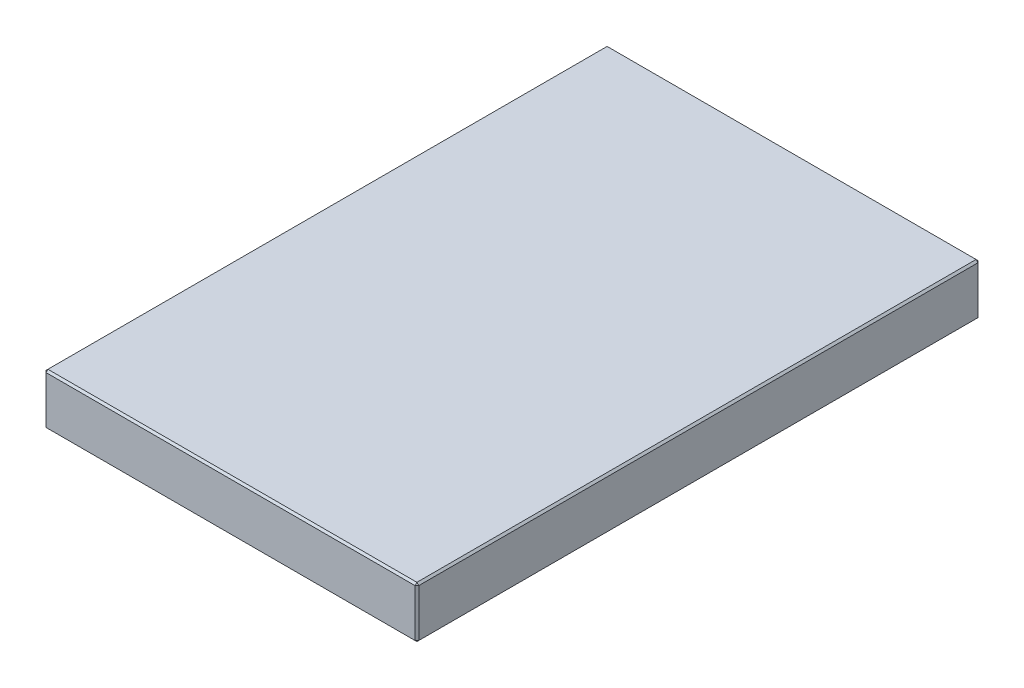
ISO-10303-21;
HEADER;
FILE_DESCRIPTION(('STEP AP214'),'2;1');
FILE_NAME('part.step','',(''),(''),'','','');
FILE_SCHEMA(('AUTOMOTIVE_DESIGN { 1 0 10303 214 1 1 1 1 }'));
ENDSEC;
DATA;
#1=APPLICATION_CONTEXT('core data for automotive mechanical design processes');
#2=APPLICATION_PROTOCOL_DEFINITION('international standard','automotive_design',2000,#1);
#3=PRODUCT_CONTEXT('',#1,'mechanical');
#4=PRODUCT('Part','Part','',(#3));
#5=PRODUCT_RELATED_PRODUCT_CATEGORY('part','',(#4));
#6=PRODUCT_DEFINITION_FORMATION('','',#4);
#7=PRODUCT_DEFINITION_CONTEXT('part definition',#1,'design');
#8=PRODUCT_DEFINITION('design','',#6,#7);
#9=PRODUCT_DEFINITION_SHAPE('','',#8);
#10=(LENGTH_UNIT() NAMED_UNIT(*) SI_UNIT(.MILLI.,.METRE.));
#11=(NAMED_UNIT(*) PLANE_ANGLE_UNIT() SI_UNIT($,.RADIAN.));
#12=(NAMED_UNIT(*) SI_UNIT($,.STERADIAN.) SOLID_ANGLE_UNIT());
#13=UNCERTAINTY_MEASURE_WITH_UNIT(LENGTH_MEASURE(1.E-05),#10,'distance_accuracy_value','');
#14=(GEOMETRIC_REPRESENTATION_CONTEXT(3) GLOBAL_UNCERTAINTY_ASSIGNED_CONTEXT((#13)) GLOBAL_UNIT_ASSIGNED_CONTEXT((#10,
#11,#12)) REPRESENTATION_CONTEXT('',''));
#15=CARTESIAN_POINT('',(0.,0.,0.));
#16=DIRECTION('',(0.,0.,1.));
#17=DIRECTION('',(1.,0.,0.));
#18=AXIS2_PLACEMENT_3D('',#15,#16,#17);
#19=CARTESIAN_POINT('',(-98.,27.,148.));
#20=DIRECTION('',(1.,0.,0.));
#21=DIRECTION('',(0.,0.,-1.));
#22=AXIS2_PLACEMENT_3D('',#19,#20,#21);
#23=PLANE('',#22);
#24=DIRECTION('',(0.,-1.,0.));
#25=VECTOR('',#24,1.);
#26=CARTESIAN_POINT('',(-98.,27.,-147.));
#27=LINE('',#26,#25);
#28=CARTESIAN_POINT('',(-98.,26.,-147.));
#29=VERTEX_POINT('',#28);
#30=CARTESIAN_POINT('',(-98.,1.,-147.));
#31=VERTEX_POINT('',#30);
#32=EDGE_CURVE('E115',#29,#31,#27,.T.);
#33=ORIENTED_EDGE('',*,*,#32,.T.);
#34=DIRECTION('',(0.,0.,1.));
#35=VECTOR('',#34,1.);
#36=CARTESIAN_POINT('',(-98.,1.,148.));
#37=LINE('',#36,#35);
#38=CARTESIAN_POINT('',(-98.,1.,147.));
#39=VERTEX_POINT('',#38);
#40=EDGE_CURVE('E111',#31,#39,#37,.T.);
#41=ORIENTED_EDGE('',*,*,#40,.T.);
#42=DIRECTION('',(0.,1.,0.));
#43=VECTOR('',#42,1.);
#44=CARTESIAN_POINT('',(-98.,27.,147.));
#45=LINE('',#44,#43);
#46=CARTESIAN_POINT('',(-98.,26.,147.));
#47=VERTEX_POINT('',#46);
#48=EDGE_CURVE('E104',#39,#47,#45,.T.);
#49=ORIENTED_EDGE('',*,*,#48,.T.);
#50=DIRECTION('',(0.,0.,-1.));
#51=VECTOR('',#50,1.);
#52=CARTESIAN_POINT('',(-98.,26.,-148.));
#53=LINE('',#52,#51);
#54=EDGE_CURVE('E108',#47,#29,#53,.T.);
#55=ORIENTED_EDGE('',*,*,#54,.T.);
#56=EDGE_LOOP('',(#33,#41,#49,#55));
#57=FACE_BOUND('',#56,.T.);
#58=ADVANCED_FACE('F16',(#57),#23,.F.);
#59=CARTESIAN_POINT('',(98.,27.,148.));
#60=DIRECTION('',(0.,0.,-1.));
#61=DIRECTION('',(-1.,0.,0.));
#62=AXIS2_PLACEMENT_3D('',#59,#60,#61);
#63=PLANE('',#62);
#64=DIRECTION('',(-1.,0.,0.));
#65=VECTOR('',#64,1.);
#66=CARTESIAN_POINT('',(-98.,26.,148.));
#67=LINE('',#66,#65);
#68=CARTESIAN_POINT('',(97.,26.,148.));
#69=VERTEX_POINT('',#68);
#70=CARTESIAN_POINT('',(-97.,26.,148.));
#71=VERTEX_POINT('',#70);
#72=EDGE_CURVE('E165',#69,#71,#67,.T.);
#73=ORIENTED_EDGE('',*,*,#72,.T.);
#74=DIRECTION('',(0.,-1.,0.));
#75=VECTOR('',#74,1.);
#76=CARTESIAN_POINT('',(-97.,27.,148.));
#77=LINE('',#76,#75);
#78=CARTESIAN_POINT('',(-97.,1.,148.));
#79=VERTEX_POINT('',#78);
#80=EDGE_CURVE('E123',#71,#79,#77,.T.);
#81=ORIENTED_EDGE('',*,*,#80,.T.);
#82=DIRECTION('',(1.,0.,0.));
#83=VECTOR('',#82,1.);
#84=CARTESIAN_POINT('',(98.,1.,148.));
#85=LINE('',#84,#83);
#86=CARTESIAN_POINT('',(97.,1.,148.));
#87=VERTEX_POINT('',#86);
#88=EDGE_CURVE('E169',#79,#87,#85,.T.);
#89=ORIENTED_EDGE('',*,*,#88,.T.);
#90=DIRECTION('',(0.,1.,0.));
#91=VECTOR('',#90,1.);
#92=CARTESIAN_POINT('',(97.,27.,148.));
#93=LINE('',#92,#91);
#94=EDGE_CURVE('E167',#87,#69,#93,.T.);
#95=ORIENTED_EDGE('',*,*,#94,.T.);
#96=EDGE_LOOP('',(#73,#81,#89,#95));
#97=FACE_BOUND('',#96,.T.);
#98=ADVANCED_FACE('F276',(#97),#63,.F.);
#99=CARTESIAN_POINT('',(98.,27.,148.));
#100=DIRECTION('',(-1.,0.,0.));
#101=DIRECTION('',(0.,0.,1.));
#102=AXIS2_PLACEMENT_3D('',#99,#100,#101);
#103=PLANE('',#102);
#104=DIRECTION('',(0.,0.,-1.));
#105=VECTOR('',#104,1.);
#106=CARTESIAN_POINT('',(98.,1.,148.));
#107=LINE('',#106,#105);
#108=CARTESIAN_POINT('',(98.,1.,147.));
#109=VERTEX_POINT('',#108);
#110=CARTESIAN_POINT('',(98.,1.,-147.));
#111=VERTEX_POINT('',#110);
#112=EDGE_CURVE('E160',#109,#111,#107,.T.);
#113=ORIENTED_EDGE('',*,*,#112,.T.);
#114=DIRECTION('',(0.,1.,0.));
#115=VECTOR('',#114,1.);
#116=CARTESIAN_POINT('',(98.,27.,-147.));
#117=LINE('',#116,#115);
#118=CARTESIAN_POINT('',(98.,26.,-147.));
#119=VERTEX_POINT('',#118);
#120=EDGE_CURVE('E162',#111,#119,#117,.T.);
#121=ORIENTED_EDGE('',*,*,#120,.T.);
#122=DIRECTION('',(0.,0.,1.));
#123=VECTOR('',#122,1.);
#124=CARTESIAN_POINT('',(98.,26.,148.));
#125=LINE('',#124,#123);
#126=CARTESIAN_POINT('',(98.,26.,147.));
#127=VERTEX_POINT('',#126);
#128=EDGE_CURVE('E156',#119,#127,#125,.T.);
#129=ORIENTED_EDGE('',*,*,#128,.T.);
#130=DIRECTION('',(0.,-1.,0.));
#131=VECTOR('',#130,1.);
#132=CARTESIAN_POINT('',(98.,27.,147.));
#133=LINE('',#132,#131);
#134=EDGE_CURVE('E158',#127,#109,#133,.T.);
#135=ORIENTED_EDGE('',*,*,#134,.T.);
#136=EDGE_LOOP('',(#113,#121,#129,#135));
#137=FACE_BOUND('',#136,.T.);
#138=ADVANCED_FACE('F255',(#137),#103,.F.);
#139=CARTESIAN_POINT('',(98.,27.,-148.));
#140=DIRECTION('',(0.,0.,1.));
#141=DIRECTION('',(1.,0.,0.));
#142=AXIS2_PLACEMENT_3D('',#139,#140,#141);
#143=PLANE('',#142);
#144=DIRECTION('',(0.,-1.,0.));
#145=VECTOR('',#144,1.);
#146=CARTESIAN_POINT('',(97.,27.,-148.));
#147=LINE('',#146,#145);
#148=CARTESIAN_POINT('',(97.,26.,-148.));
#149=VERTEX_POINT('',#148);
#150=CARTESIAN_POINT('',(97.,1.,-148.));
#151=VERTEX_POINT('',#150);
#152=EDGE_CURVE('E149',#149,#151,#147,.T.);
#153=ORIENTED_EDGE('',*,*,#152,.T.);
#154=DIRECTION('',(-1.,0.,0.));
#155=VECTOR('',#154,1.);
#156=CARTESIAN_POINT('',(98.,1.,-148.));
#157=LINE('',#156,#155);
#158=CARTESIAN_POINT('',(-97.,1.,-148.));
#159=VERTEX_POINT('',#158);
#160=EDGE_CURVE('E154',#151,#159,#157,.T.);
#161=ORIENTED_EDGE('',*,*,#160,.T.);
#162=DIRECTION('',(0.,1.,0.));
#163=VECTOR('',#162,1.);
#164=CARTESIAN_POINT('',(-97.,27.,-148.));
#165=LINE('',#164,#163);
#166=CARTESIAN_POINT('',(-97.,26.,-148.));
#167=VERTEX_POINT('',#166);
#168=EDGE_CURVE('E151',#159,#167,#165,.T.);
#169=ORIENTED_EDGE('',*,*,#168,.T.);
#170=DIRECTION('',(1.,0.,0.));
#171=VECTOR('',#170,1.);
#172=CARTESIAN_POINT('',(98.,26.,-148.));
#173=LINE('',#172,#171);
#174=EDGE_CURVE('E147',#167,#149,#173,.T.);
#175=ORIENTED_EDGE('',*,*,#174,.T.);
#176=EDGE_LOOP('',(#153,#161,#169,#175));
#177=FACE_BOUND('',#176,.T.);
#178=ADVANCED_FACE('F285',(#177),#143,.F.);
#179=CARTESIAN_POINT('',(0.,27.,0.));
#180=DIRECTION('',(0.,1.,0.));
#181=DIRECTION('',(0.,0.,1.));
#182=AXIS2_PLACEMENT_3D('',#179,#180,#181);
#183=PLANE('',#182);
#184=DIRECTION('',(0.,0.,-1.));
#185=VECTOR('',#184,1.);
#186=CARTESIAN_POINT('',(97.,27.,-148.));
#187=LINE('',#186,#185);
#188=CARTESIAN_POINT('',(97.,27.,147.));
#189=VERTEX_POINT('',#188);
#190=CARTESIAN_POINT('',(97.,27.,-147.));
#191=VERTEX_POINT('',#190);
#192=EDGE_CURVE('E25',#189,#191,#187,.T.);
#193=ORIENTED_EDGE('',*,*,#192,.T.);
#194=DIRECTION('',(-1.,0.,0.));
#195=VECTOR('',#194,1.);
#196=CARTESIAN_POINT('',(-98.,27.,-147.));
#197=LINE('',#196,#195);
#198=CARTESIAN_POINT('',(-97.,27.,-147.));
#199=VERTEX_POINT('',#198);
#200=EDGE_CURVE('E10',#191,#199,#197,.T.);
#201=ORIENTED_EDGE('',*,*,#200,.T.);
#202=DIRECTION('',(0.,0.,1.));
#203=VECTOR('',#202,1.);
#204=CARTESIAN_POINT('',(-97.,27.,148.));
#205=LINE('',#204,#203);
#206=CARTESIAN_POINT('',(-97.,27.,147.));
#207=VERTEX_POINT('',#206);
#208=EDGE_CURVE('E181',#199,#207,#205,.T.);
#209=ORIENTED_EDGE('',*,*,#208,.T.);
#210=DIRECTION('',(1.,0.,0.));
#211=VECTOR('',#210,1.);
#212=CARTESIAN_POINT('',(98.,27.,147.));
#213=LINE('',#212,#211);
#214=EDGE_CURVE('E36',#207,#189,#213,.T.);
#215=ORIENTED_EDGE('',*,*,#214,.T.);
#216=EDGE_LOOP('',(#193,#201,#209,#215));
#217=FACE_BOUND('',#216,.T.);
#218=ADVANCED_FACE('F351',(#217),#183,.T.);
#219=CARTESIAN_POINT('',(0.,0.,0.));
#220=DIRECTION('',(0.,1.,0.));
#221=DIRECTION('',(0.,0.,1.));
#222=AXIS2_PLACEMENT_3D('',#219,#220,#221);
#223=PLANE('',#222);
#224=DIRECTION('',(0.,0.,1.));
#225=VECTOR('',#224,1.);
#226=CARTESIAN_POINT('',(97.,0.,0.));
#227=LINE('',#226,#225);
#228=CARTESIAN_POINT('',(97.,0.,-147.));
#229=VERTEX_POINT('',#228);
#230=CARTESIAN_POINT('',(97.,0.,147.));
#231=VERTEX_POINT('',#230);
#232=EDGE_CURVE('E172',#229,#231,#227,.T.);
#233=ORIENTED_EDGE('',*,*,#232,.T.);
#234=DIRECTION('',(-1.,0.,0.));
#235=VECTOR('',#234,1.);
#236=CARTESIAN_POINT('',(0.,0.,147.));
#237=LINE('',#236,#235);
#238=CARTESIAN_POINT('',(-97.,0.,147.));
#239=VERTEX_POINT('',#238);
#240=EDGE_CURVE('E178',#231,#239,#237,.T.);
#241=ORIENTED_EDGE('',*,*,#240,.T.);
#242=DIRECTION('',(0.,0.,-1.));
#243=VECTOR('',#242,1.);
#244=CARTESIAN_POINT('',(-97.,0.,0.));
#245=LINE('',#244,#243);
#246=CARTESIAN_POINT('',(-97.,0.,-147.));
#247=VERTEX_POINT('',#246);
#248=EDGE_CURVE('E176',#239,#247,#245,.T.);
#249=ORIENTED_EDGE('',*,*,#248,.T.);
#250=DIRECTION('',(1.,0.,0.));
#251=VECTOR('',#250,1.);
#252=CARTESIAN_POINT('',(0.,0.,-147.));
#253=LINE('',#252,#251);
#254=EDGE_CURVE('E174',#247,#229,#253,.T.);
#255=ORIENTED_EDGE('',*,*,#254,.T.);
#256=EDGE_LOOP('',(#233,#241,#249,#255));
#257=FACE_BOUND('',#256,.T.);
#258=ADVANCED_FACE('F247',(#257),#223,.F.);
#259=CARTESIAN_POINT('',(98.,27.,147.));
#260=DIRECTION('',(-0.707106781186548,0.,-0.707106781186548));
#261=DIRECTION('',(0.,-1.,0.));
#262=AXIS2_PLACEMENT_3D('',#259,#260,#261);
#263=PLANE('',#262);
#264=DIRECTION('',(-0.707106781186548,0.,0.707106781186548));
#265=VECTOR('',#264,1.);
#266=CARTESIAN_POINT('',(97.,26.,148.));
#267=LINE('',#266,#265);
#268=EDGE_CURVE('E20',#69,#127,#267,.F.);
#269=ORIENTED_EDGE('',*,*,#268,.F.);
#270=ORIENTED_EDGE('',*,*,#94,.F.);
#271=DIRECTION('',(0.707106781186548,0.,-0.707106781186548));
#272=VECTOR('',#271,1.);
#273=CARTESIAN_POINT('',(97.,1.,148.));
#274=LINE('',#273,#272);
#275=EDGE_CURVE('E143',#109,#87,#274,.F.);
#276=ORIENTED_EDGE('',*,*,#275,.F.);
#277=ORIENTED_EDGE('',*,*,#134,.F.);
#278=EDGE_LOOP('',(#269,#270,#276,#277));
#279=FACE_BOUND('',#278,.T.);
#280=ADVANCED_FACE('F18',(#279),#263,.F.);
#281=CARTESIAN_POINT('',(97.,26.,148.));
#282=DIRECTION('',(0.577350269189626,0.577350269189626,0.577350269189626));
#283=DIRECTION('',(0.707106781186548,0.,-0.707106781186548));
#284=AXIS2_PLACEMENT_3D('',#281,#282,#283);
#285=PLANE('',#284);
#286=DIRECTION('',(0.,-0.707106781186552,0.707106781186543));
#287=VECTOR('',#286,1.);
#288=CARTESIAN_POINT('',(97.,26.,148.));
#289=LINE('',#288,#287);
#290=EDGE_CURVE('E227',#69,#189,#289,.F.);
#291=ORIENTED_EDGE('',*,*,#290,.F.);
#292=ORIENTED_EDGE('',*,*,#268,.T.);
#293=DIRECTION('',(-0.707106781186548,0.707106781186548,0.));
#294=VECTOR('',#293,1.);
#295=CARTESIAN_POINT('',(97.5,26.5,147.));
#296=LINE('',#295,#294);
#297=EDGE_CURVE('E229',#189,#127,#296,.F.);
#298=ORIENTED_EDGE('',*,*,#297,.F.);
#299=EDGE_LOOP('',(#291,#292,#298));
#300=FACE_BOUND('',#299,.T.);
#301=ADVANCED_FACE('F271',(#300),#285,.T.);
#302=CARTESIAN_POINT('',(97.,1.,148.));
#303=DIRECTION('',(0.577350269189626,-0.577350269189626,0.577350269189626));
#304=DIRECTION('',(0.707106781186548,0.,-0.707106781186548));
#305=AXIS2_PLACEMENT_3D('',#302,#303,#304);
#306=PLANE('',#305);
#307=DIRECTION('',(-0.707106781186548,-0.707106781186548,0.));
#308=VECTOR('',#307,1.);
#309=CARTESIAN_POINT('',(97.5,0.5,147.));
#310=LINE('',#309,#308);
#311=EDGE_CURVE('E221',#109,#231,#310,.T.);
#312=ORIENTED_EDGE('',*,*,#311,.F.);
#313=ORIENTED_EDGE('',*,*,#275,.T.);
#314=DIRECTION('',(0.,0.707106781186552,0.707106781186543));
#315=VECTOR('',#314,1.);
#316=CARTESIAN_POINT('',(97.,1.,148.));
#317=LINE('',#316,#315);
#318=EDGE_CURVE('E224',#231,#87,#317,.T.);
#319=ORIENTED_EDGE('',*,*,#318,.F.);
#320=EDGE_LOOP('',(#312,#313,#319));
#321=FACE_BOUND('',#320,.T.);
#322=ADVANCED_FACE('F236',(#321),#306,.T.);
#323=CARTESIAN_POINT('',(97.,27.,0.));
#324=DIRECTION('',(0.707106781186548,0.707106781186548,0.));
#325=DIRECTION('',(0.,0.,1.));
#326=AXIS2_PLACEMENT_3D('',#323,#324,#325);
#327=PLANE('',#326);
#328=ORIENTED_EDGE('',*,*,#297,.T.);
#329=ORIENTED_EDGE('',*,*,#128,.F.);
#330=DIRECTION('',(0.707106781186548,-0.707106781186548,0.));
#331=VECTOR('',#330,1.);
#332=CARTESIAN_POINT('',(98.,26.,-147.));
#333=LINE('',#332,#331);
#334=EDGE_CURVE('E216',#191,#119,#333,.T.);
#335=ORIENTED_EDGE('',*,*,#334,.F.);
#336=ORIENTED_EDGE('',*,*,#192,.F.);
#337=EDGE_LOOP('',(#328,#329,#335,#336));
#338=FACE_BOUND('',#337,.T.);
#339=ADVANCED_FACE('F266',(#338),#327,.T.);
#340=CARTESIAN_POINT('',(0.,27.,147.));
#341=DIRECTION('',(0.,0.707106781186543,0.707106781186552));
#342=DIRECTION('',(-1.,0.,0.));
#343=AXIS2_PLACEMENT_3D('',#340,#341,#342);
#344=PLANE('',#343);
#345=ORIENTED_EDGE('',*,*,#290,.T.);
#346=ORIENTED_EDGE('',*,*,#214,.F.);
#347=DIRECTION('',(0.,0.707106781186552,-0.707106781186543));
#348=VECTOR('',#347,1.);
#349=CARTESIAN_POINT('',(-97.,26.5,147.5));
#350=LINE('',#349,#348);
#351=EDGE_CURVE('E127',#71,#207,#350,.T.);
#352=ORIENTED_EDGE('',*,*,#351,.F.);
#353=ORIENTED_EDGE('',*,*,#72,.F.);
#354=EDGE_LOOP('',(#345,#346,#352,#353));
#355=FACE_BOUND('',#354,.T.);
#356=ADVANCED_FACE('F274',(#355),#344,.T.);
#357=CARTESIAN_POINT('',(-97.,27.,148.));
#358=DIRECTION('',(0.707106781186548,0.,-0.707106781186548));
#359=DIRECTION('',(0.,-1.,0.));
#360=AXIS2_PLACEMENT_3D('',#357,#358,#359);
#361=PLANE('',#360);
#362=DIRECTION('',(0.707106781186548,0.,0.707106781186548));
#363=VECTOR('',#362,1.);
#364=CARTESIAN_POINT('',(-97.,1.,148.));
#365=LINE('',#364,#363);
#366=EDGE_CURVE('E128',#79,#39,#365,.F.);
#367=ORIENTED_EDGE('',*,*,#366,.F.);
#368=ORIENTED_EDGE('',*,*,#80,.F.);
#369=DIRECTION('',(-0.707106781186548,0.,-0.707106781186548));
#370=VECTOR('',#369,1.);
#371=CARTESIAN_POINT('',(-98.,26.,147.));
#372=LINE('',#371,#370);
#373=EDGE_CURVE('E119',#47,#71,#372,.F.);
#374=ORIENTED_EDGE('',*,*,#373,.F.);
#375=ORIENTED_EDGE('',*,*,#48,.F.);
#376=EDGE_LOOP('',(#367,#368,#374,#375));
#377=FACE_BOUND('',#376,.T.);
#378=ADVANCED_FACE('F121',(#377),#361,.F.);
#379=CARTESIAN_POINT('',(98.,1.,148.));
#380=DIRECTION('',(0.,0.707106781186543,-0.707106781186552));
#381=DIRECTION('',(1.,0.,0.));
#382=AXIS2_PLACEMENT_3D('',#379,#380,#381);
#383=PLANE('',#382);
#384=ORIENTED_EDGE('',*,*,#318,.T.);
#385=ORIENTED_EDGE('',*,*,#88,.F.);
#386=DIRECTION('',(0.,-0.707106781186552,-0.707106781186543));
#387=VECTOR('',#386,1.);
#388=CARTESIAN_POINT('',(-97.,1.,148.));
#389=LINE('',#388,#387);
#390=EDGE_CURVE('E212',#239,#79,#389,.F.);
#391=ORIENTED_EDGE('',*,*,#390,.F.);
#392=ORIENTED_EDGE('',*,*,#240,.F.);
#393=EDGE_LOOP('',(#384,#385,#391,#392));
#394=FACE_BOUND('',#393,.T.);
#395=ADVANCED_FACE('F244',(#394),#383,.F.);
#396=CARTESIAN_POINT('',(98.,1.,148.));
#397=DIRECTION('',(-0.707106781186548,0.707106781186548,0.));
#398=DIRECTION('',(0.,0.,-1.));
#399=AXIS2_PLACEMENT_3D('',#396,#397,#398);
#400=PLANE('',#399);
#401=ORIENTED_EDGE('',*,*,#311,.T.);
#402=ORIENTED_EDGE('',*,*,#232,.F.);
#403=DIRECTION('',(0.707106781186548,0.707106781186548,0.));
#404=VECTOR('',#403,1.);
#405=CARTESIAN_POINT('',(97.5,0.5,-147.));
#406=LINE('',#405,#404);
#407=EDGE_CURVE('E209',#111,#229,#406,.F.);
#408=ORIENTED_EDGE('',*,*,#407,.F.);
#409=ORIENTED_EDGE('',*,*,#112,.F.);
#410=EDGE_LOOP('',(#401,#402,#408,#409));
#411=FACE_BOUND('',#410,.T.);
#412=ADVANCED_FACE('F252',(#411),#400,.F.);
#413=CARTESIAN_POINT('',(97.,27.,-148.));
#414=DIRECTION('',(-0.707106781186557,0.,0.707106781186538));
#415=DIRECTION('',(0.,-1.,0.));
#416=AXIS2_PLACEMENT_3D('',#413,#414,#415);
#417=PLANE('',#416);
#418=DIRECTION('',(0.707106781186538,0.,0.707106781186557));
#419=VECTOR('',#418,1.);
#420=CARTESIAN_POINT('',(98.,26.,-147.));
#421=LINE('',#420,#419);
#422=EDGE_CURVE('E218',#119,#149,#421,.F.);
#423=ORIENTED_EDGE('',*,*,#422,.F.);
#424=ORIENTED_EDGE('',*,*,#120,.F.);
#425=DIRECTION('',(-0.707106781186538,0.,-0.707106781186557));
#426=VECTOR('',#425,1.);
#427=CARTESIAN_POINT('',(97.,1.,-148.));
#428=LINE('',#427,#426);
#429=EDGE_CURVE('E206',#151,#111,#428,.F.);
#430=ORIENTED_EDGE('',*,*,#429,.F.);
#431=ORIENTED_EDGE('',*,*,#152,.F.);
#432=EDGE_LOOP('',(#423,#424,#430,#431));
#433=FACE_BOUND('',#432,.T.);
#434=ADVANCED_FACE('F259',(#433),#417,.F.);
#435=CARTESIAN_POINT('',(98.,26.,-147.));
#436=DIRECTION('',(0.577350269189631,0.577350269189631,-0.577350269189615));
#437=DIRECTION('',(-0.707106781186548,0.707106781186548,0.));
#438=AXIS2_PLACEMENT_3D('',#435,#436,#437);
#439=PLANE('',#438);
#440=ORIENTED_EDGE('',*,*,#334,.T.);
#441=ORIENTED_EDGE('',*,*,#422,.T.);
#442=DIRECTION('',(0.,0.707106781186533,0.707106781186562));
#443=VECTOR('',#442,1.);
#444=CARTESIAN_POINT('',(97.,26.5,-147.5));
#445=LINE('',#444,#443);
#446=EDGE_CURVE('E135',#191,#149,#445,.F.);
#447=ORIENTED_EDGE('',*,*,#446,.F.);
#448=EDGE_LOOP('',(#440,#441,#447));
#449=FACE_BOUND('',#448,.T.);
#450=ADVANCED_FACE('F326',(#449),#439,.T.);
#451=CARTESIAN_POINT('',(-98.,26.,147.));
#452=DIRECTION('',(-0.577350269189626,0.577350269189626,0.577350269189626));
#453=DIRECTION('',(0.707106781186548,0.,0.707106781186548));
#454=AXIS2_PLACEMENT_3D('',#451,#452,#453);
#455=PLANE('',#454);
#456=ORIENTED_EDGE('',*,*,#373,.T.);
#457=ORIENTED_EDGE('',*,*,#351,.T.);
#458=DIRECTION('',(-0.707106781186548,-0.707106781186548,0.));
#459=VECTOR('',#458,1.);
#460=CARTESIAN_POINT('',(-98.,26.,147.));
#461=LINE('',#460,#459);
#462=EDGE_CURVE('E131',#47,#207,#461,.F.);
#463=ORIENTED_EDGE('',*,*,#462,.F.);
#464=EDGE_LOOP('',(#456,#457,#463));
#465=FACE_BOUND('',#464,.T.);
#466=ADVANCED_FACE('F132',(#465),#455,.T.);
#467=CARTESIAN_POINT('',(-97.,1.,148.));
#468=DIRECTION('',(-0.577350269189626,-0.577350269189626,0.577350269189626));
#469=DIRECTION('',(0.707106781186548,0.,0.707106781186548));
#470=AXIS2_PLACEMENT_3D('',#467,#468,#469);
#471=PLANE('',#470);
#472=ORIENTED_EDGE('',*,*,#390,.T.);
#473=ORIENTED_EDGE('',*,*,#366,.T.);
#474=DIRECTION('',(-0.707106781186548,0.707106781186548,0.));
#475=VECTOR('',#474,1.);
#476=CARTESIAN_POINT('',(-97.5,0.5,147.));
#477=LINE('',#476,#475);
#478=EDGE_CURVE('E136',#239,#39,#477,.T.);
#479=ORIENTED_EDGE('',*,*,#478,.F.);
#480=EDGE_LOOP('',(#472,#473,#479));
#481=FACE_BOUND('',#480,.T.);
#482=ADVANCED_FACE('F319',(#481),#471,.T.);
#483=CARTESIAN_POINT('',(97.,1.,-148.));
#484=DIRECTION('',(0.577350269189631,-0.577350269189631,-0.577350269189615));
#485=DIRECTION('',(0.707106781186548,0.707106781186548,0.));
#486=AXIS2_PLACEMENT_3D('',#483,#484,#485);
#487=PLANE('',#486);
#488=ORIENTED_EDGE('',*,*,#429,.T.);
#489=ORIENTED_EDGE('',*,*,#407,.T.);
#490=DIRECTION('',(0.,-0.707106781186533,0.707106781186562));
#491=VECTOR('',#490,1.);
#492=CARTESIAN_POINT('',(97.,1.,-148.));
#493=LINE('',#492,#491);
#494=EDGE_CURVE('E199',#151,#229,#493,.T.);
#495=ORIENTED_EDGE('',*,*,#494,.F.);
#496=EDGE_LOOP('',(#488,#489,#495));
#497=FACE_BOUND('',#496,.T.);
#498=ADVANCED_FACE('F315',(#497),#487,.T.);
#499=CARTESIAN_POINT('',(0.,27.,-147.));
#500=DIRECTION('',(0.,0.707106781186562,-0.707106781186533));
#501=DIRECTION('',(1.,0.,0.));
#502=AXIS2_PLACEMENT_3D('',#499,#500,#501);
#503=PLANE('',#502);
#504=ORIENTED_EDGE('',*,*,#446,.T.);
#505=ORIENTED_EDGE('',*,*,#174,.F.);
#506=DIRECTION('',(0.,-0.707106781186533,-0.707106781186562));
#507=VECTOR('',#506,1.);
#508=CARTESIAN_POINT('',(-97.,26.,-148.));
#509=LINE('',#508,#507);
#510=EDGE_CURVE('E196',#199,#167,#509,.T.);
#511=ORIENTED_EDGE('',*,*,#510,.F.);
#512=ORIENTED_EDGE('',*,*,#200,.F.);
#513=EDGE_LOOP('',(#504,#505,#511,#512));
#514=FACE_BOUND('',#513,.T.);
#515=ADVANCED_FACE('F312',(#514),#503,.T.);
#516=CARTESIAN_POINT('',(-97.,27.,0.));
#517=DIRECTION('',(-0.707106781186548,0.707106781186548,0.));
#518=DIRECTION('',(0.,0.,-1.));
#519=AXIS2_PLACEMENT_3D('',#516,#517,#518);
#520=PLANE('',#519);
#521=ORIENTED_EDGE('',*,*,#462,.T.);
#522=ORIENTED_EDGE('',*,*,#208,.F.);
#523=DIRECTION('',(0.707106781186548,0.707106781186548,0.));
#524=VECTOR('',#523,1.);
#525=CARTESIAN_POINT('',(-97.5,26.5,-147.));
#526=LINE('',#525,#524);
#527=EDGE_CURVE('E139',#29,#199,#526,.T.);
#528=ORIENTED_EDGE('',*,*,#527,.F.);
#529=ORIENTED_EDGE('',*,*,#54,.F.);
#530=EDGE_LOOP('',(#521,#522,#528,#529));
#531=FACE_BOUND('',#530,.T.);
#532=ADVANCED_FACE('F138',(#531),#520,.T.);
#533=CARTESIAN_POINT('',(-98.,1.,148.));
#534=DIRECTION('',(0.707106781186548,0.707106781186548,0.));
#535=DIRECTION('',(0.,0.,1.));
#536=AXIS2_PLACEMENT_3D('',#533,#534,#535);
#537=PLANE('',#536);
#538=ORIENTED_EDGE('',*,*,#478,.T.);
#539=ORIENTED_EDGE('',*,*,#40,.F.);
#540=DIRECTION('',(0.707106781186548,-0.707106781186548,0.));
#541=VECTOR('',#540,1.);
#542=CARTESIAN_POINT('',(-98.,1.,-147.));
#543=LINE('',#542,#541);
#544=EDGE_CURVE('E192',#247,#31,#543,.F.);
#545=ORIENTED_EDGE('',*,*,#544,.F.);
#546=ORIENTED_EDGE('',*,*,#248,.F.);
#547=EDGE_LOOP('',(#538,#539,#545,#546));
#548=FACE_BOUND('',#547,.T.);
#549=ADVANCED_FACE('F305',(#548),#537,.F.);
#550=CARTESIAN_POINT('',(98.,1.,-148.));
#551=DIRECTION('',(0.,0.707106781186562,0.707106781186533));
#552=DIRECTION('',(-1.,0.,0.));
#553=AXIS2_PLACEMENT_3D('',#550,#551,#552);
#554=PLANE('',#553);
#555=ORIENTED_EDGE('',*,*,#494,.T.);
#556=ORIENTED_EDGE('',*,*,#254,.F.);
#557=DIRECTION('',(0.,0.707106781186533,-0.707106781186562));
#558=VECTOR('',#557,1.);
#559=CARTESIAN_POINT('',(-97.,0.49999999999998,-147.5));
#560=LINE('',#559,#558);
#561=EDGE_CURVE('E189',#159,#247,#560,.F.);
#562=ORIENTED_EDGE('',*,*,#561,.F.);
#563=ORIENTED_EDGE('',*,*,#160,.F.);
#564=EDGE_LOOP('',(#555,#556,#562,#563));
#565=FACE_BOUND('',#564,.T.);
#566=ADVANCED_FACE('F301',(#565),#554,.F.);
#567=CARTESIAN_POINT('',(-97.,26.,-148.));
#568=DIRECTION('',(-0.577350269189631,0.577350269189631,-0.577350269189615));
#569=DIRECTION('',(-0.707106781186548,-0.707106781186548,0.));
#570=AXIS2_PLACEMENT_3D('',#567,#568,#569);
#571=PLANE('',#570);
#572=ORIENTED_EDGE('',*,*,#527,.T.);
#573=ORIENTED_EDGE('',*,*,#510,.T.);
#574=DIRECTION('',(0.707106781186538,0.,-0.707106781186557));
#575=VECTOR('',#574,1.);
#576=CARTESIAN_POINT('',(-97.,26.,-148.));
#577=LINE('',#576,#575);
#578=EDGE_CURVE('E187',#29,#167,#577,.T.);
#579=ORIENTED_EDGE('',*,*,#578,.F.);
#580=EDGE_LOOP('',(#572,#573,#579));
#581=FACE_BOUND('',#580,.T.);
#582=ADVANCED_FACE('F297',(#581),#571,.T.);
#583=CARTESIAN_POINT('',(-98.,1.,-147.));
#584=DIRECTION('',(-0.577350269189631,-0.577350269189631,-0.577350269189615));
#585=DIRECTION('',(0.707106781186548,-0.707106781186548,0.));
#586=AXIS2_PLACEMENT_3D('',#583,#584,#585);
#587=PLANE('',#586);
#588=ORIENTED_EDGE('',*,*,#561,.T.);
#589=ORIENTED_EDGE('',*,*,#544,.T.);
#590=DIRECTION('',(-0.707106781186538,0.,0.707106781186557));
#591=VECTOR('',#590,1.);
#592=CARTESIAN_POINT('',(-98.,1.,-147.));
#593=LINE('',#592,#591);
#594=EDGE_CURVE('E185',#159,#31,#593,.T.);
#595=ORIENTED_EDGE('',*,*,#594,.F.);
#596=EDGE_LOOP('',(#588,#589,#595));
#597=FACE_BOUND('',#596,.T.);
#598=ADVANCED_FACE('F293',(#597),#587,.T.);
#599=CARTESIAN_POINT('',(-98.,27.,-147.));
#600=DIRECTION('',(0.707106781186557,0.,0.707106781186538));
#601=DIRECTION('',(0.,-1.,0.));
#602=AXIS2_PLACEMENT_3D('',#599,#600,#601);
#603=PLANE('',#602);
#604=ORIENTED_EDGE('',*,*,#578,.T.);
#605=ORIENTED_EDGE('',*,*,#168,.F.);
#606=ORIENTED_EDGE('',*,*,#594,.T.);
#607=ORIENTED_EDGE('',*,*,#32,.F.);
#608=EDGE_LOOP('',(#604,#605,#606,#607));
#609=FACE_BOUND('',#608,.T.);
#610=ADVANCED_FACE('F290',(#609),#603,.F.);
#611=CLOSED_SHELL('',(#58,#98,#138,#178,#218,#258,#280,#301,#322,#339,#356,#378,#395,#412,#434,
#450,#466,#482,#498,#515,#532,#549,#566,#582,#598,#610));
#612=MANIFOLD_SOLID_BREP('B1',#611);
#613=ADVANCED_BREP_SHAPE_REPRESENTATION('',(#18,#612),#14);
#614=SHAPE_DEFINITION_REPRESENTATION(#9,#613);
ENDSEC;
END-ISO-10303-21;
